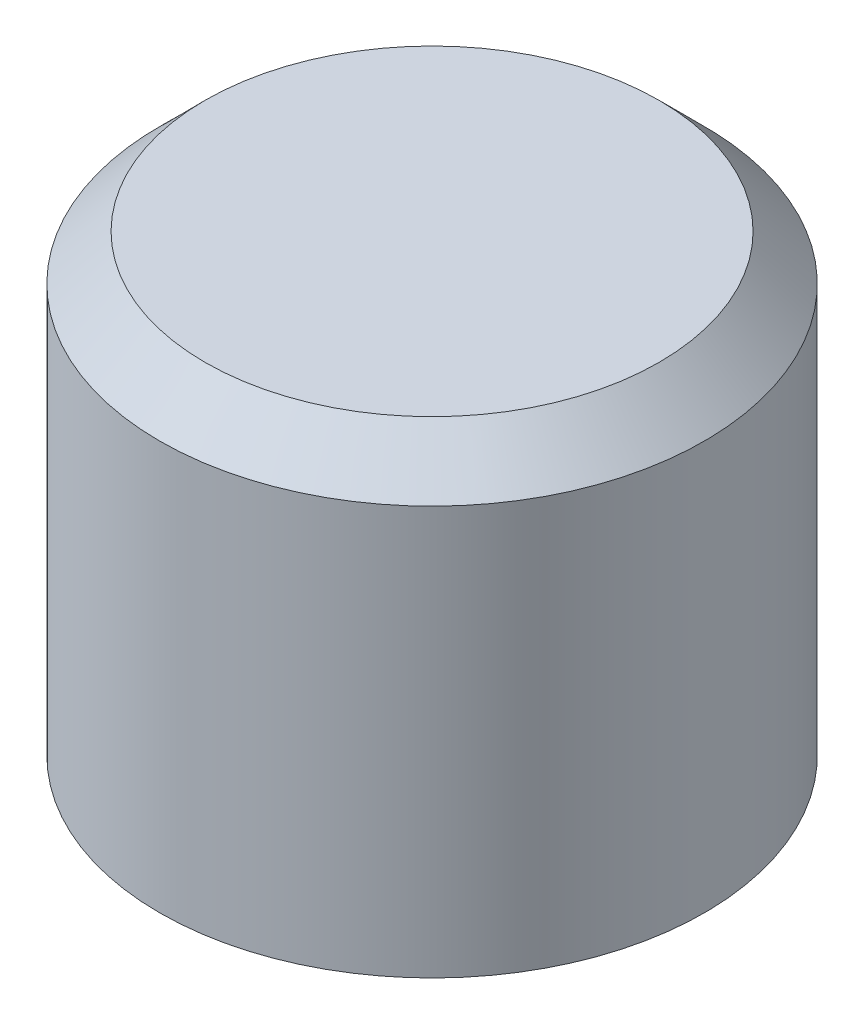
from build123d import *

# Parameters (mm, degrees)
SKETCH1_R                 = 6
BOSS_EXTRUDE1_DEPTH       = 10
CHAMFER1_SIZE             = 1
M8X1_0_TAPPED_HOLE1_D     = 7
M8X1_0_TAPPED_HOLE1_DEPTH = 6
M8X1_0_TAPPED_HOLE1_TIP   = 2.103012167


with BuildPart() as part:
    # Sketch1 → Boss-Extrude1 (new body)
    with BuildSketch(Plane(origin=(0, 0, 0), x_dir=(1, 0, 0), z_dir=(0, 1, 0))):
        with Locations(Location((0, 0, 0), (0, 0, 270))):
            Circle(SKETCH1_R)
    extrude(amount=BOSS_EXTRUDE1_DEPTH)

    # Chamfer1
    chamfer1_edges = [part.edges().sort_by_distance(p)[0] for p in [
        (0, 10, -6),
    ]]
    chamfer(chamfer1_edges, length=CHAMFER1_SIZE)

    # M8x1.0 Tapped Hole1
    with Locations(Plane(origin=(-0.11659205, 0, -0.030620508), x_dir=(0, 0, -1), z_dir=(0, -1, 0))):
        with Locations((0, 0)):
            Hole(M8X1_0_TAPPED_HOLE1_D / 2, depth=M8X1_0_TAPPED_HOLE1_DEPTH)
            with Locations((0, 0, -(M8X1_0_TAPPED_HOLE1_DEPTH + M8X1_0_TAPPED_HOLE1_TIP / 2))):  # 118° drill point
                Cone(0, M8X1_0_TAPPED_HOLE1_D / 2, M8X1_0_TAPPED_HOLE1_TIP, mode=Mode.SUBTRACT)


solid = part.part
